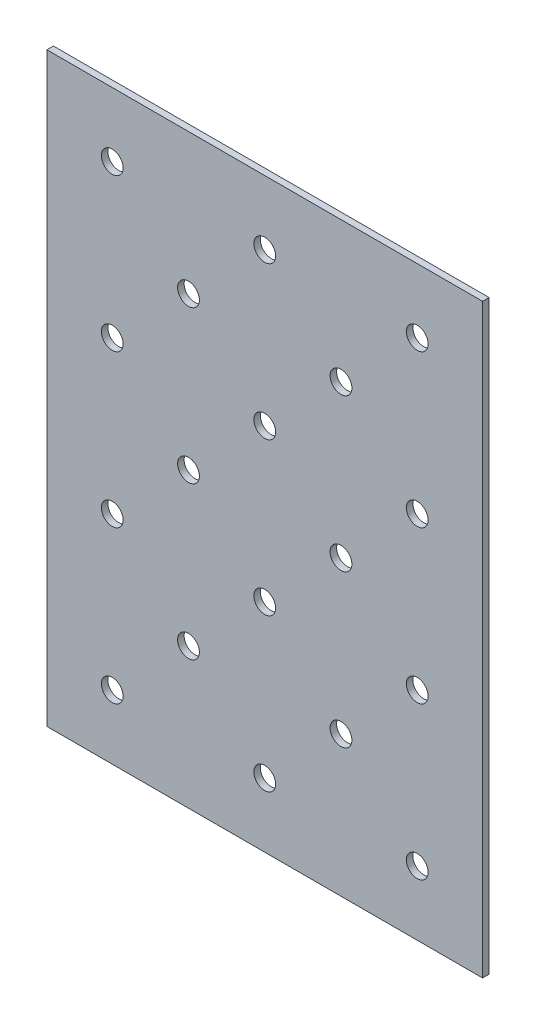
ISO-10303-21;
HEADER;
FILE_DESCRIPTION(('STEP AP214'),'2;1');
FILE_NAME('part.step','',(''),(''),'','','');
FILE_SCHEMA(('AUTOMOTIVE_DESIGN { 1 0 10303 214 1 1 1 1 }'));
ENDSEC;
DATA;
#1=APPLICATION_CONTEXT('core data for automotive mechanical design processes');
#2=APPLICATION_PROTOCOL_DEFINITION('international standard','automotive_design',2000,#1);
#3=PRODUCT_CONTEXT('',#1,'mechanical');
#4=PRODUCT('Part','Part','',(#3));
#5=PRODUCT_RELATED_PRODUCT_CATEGORY('part','',(#4));
#6=PRODUCT_DEFINITION_FORMATION('','',#4);
#7=PRODUCT_DEFINITION_CONTEXT('part definition',#1,'design');
#8=PRODUCT_DEFINITION('design','',#6,#7);
#9=PRODUCT_DEFINITION_SHAPE('','',#8);
#10=(LENGTH_UNIT() NAMED_UNIT(*) SI_UNIT(.MILLI.,.METRE.));
#11=(NAMED_UNIT(*) PLANE_ANGLE_UNIT() SI_UNIT($,.RADIAN.));
#12=(NAMED_UNIT(*) SI_UNIT($,.STERADIAN.) SOLID_ANGLE_UNIT());
#13=UNCERTAINTY_MEASURE_WITH_UNIT(LENGTH_MEASURE(1.E-05),#10,'distance_accuracy_value','');
#14=(GEOMETRIC_REPRESENTATION_CONTEXT(3) GLOBAL_UNCERTAINTY_ASSIGNED_CONTEXT((#13)) GLOBAL_UNIT_ASSIGNED_CONTEXT((#10,
#11,#12)) REPRESENTATION_CONTEXT('',''));
#15=CARTESIAN_POINT('',(0.,0.,0.));
#16=DIRECTION('',(0.,0.,1.));
#17=DIRECTION('',(1.,0.,0.));
#18=AXIS2_PLACEMENT_3D('',#15,#16,#17);
#19=CARTESIAN_POINT('',(15.6867576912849,294.5,3.));
#20=DIRECTION('',(-1.,0.,0.));
#21=DIRECTION('',(0.,-1.,0.));
#22=AXIS2_PLACEMENT_3D('',#19,#20,#21);
#23=PLANE('',#22);
#24=DIRECTION('',(0.,1.,0.));
#25=VECTOR('',#24,1.);
#26=CARTESIAN_POINT('',(15.6867576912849,294.5,0.));
#27=LINE('',#26,#25);
#28=CARTESIAN_POINT('',(15.6867576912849,25.5000000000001,0.));
#29=VERTEX_POINT('',#28);
#30=CARTESIAN_POINT('',(15.6867576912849,294.5,0.));
#31=VERTEX_POINT('',#30);
#32=EDGE_CURVE('E400',#29,#31,#27,.T.);
#33=ORIENTED_EDGE('',*,*,#32,.T.);
#34=DIRECTION('',(0.,0.,-1.));
#35=VECTOR('',#34,1.);
#36=CARTESIAN_POINT('',(15.6867576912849,294.5,3.));
#37=LINE('',#36,#35);
#38=CARTESIAN_POINT('',(15.6867576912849,294.5,3.));
#39=VERTEX_POINT('',#38);
#40=EDGE_CURVE('E11',#39,#31,#37,.T.);
#41=ORIENTED_EDGE('',*,*,#40,.F.);
#42=DIRECTION('',(0.,1.,0.));
#43=VECTOR('',#42,1.);
#44=CARTESIAN_POINT('',(15.6867576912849,294.5,3.));
#45=LINE('',#44,#43);
#46=CARTESIAN_POINT('',(15.6867576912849,25.5000000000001,3.));
#47=VERTEX_POINT('',#46);
#48=EDGE_CURVE('E423',#47,#39,#45,.T.);
#49=ORIENTED_EDGE('',*,*,#48,.F.);
#50=DIRECTION('',(0.,0.,-1.));
#51=VECTOR('',#50,1.);
#52=CARTESIAN_POINT('',(15.6867576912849,25.5000000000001,3.));
#53=LINE('',#52,#51);
#54=EDGE_CURVE('E412',#47,#29,#53,.T.);
#55=ORIENTED_EDGE('',*,*,#54,.T.);
#56=EDGE_LOOP('',(#33,#41,#49,#55));
#57=FACE_BOUND('',#56,.T.);
#58=ADVANCED_FACE('F356',(#57),#23,.F.);
#59=CARTESIAN_POINT('',(15.6867576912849,294.5,3.));
#60=DIRECTION('',(0.,-1.,0.));
#61=DIRECTION('',(1.,0.,0.));
#62=AXIS2_PLACEMENT_3D('',#59,#60,#61);
#63=PLANE('',#62);
#64=DIRECTION('',(-1.,0.,0.));
#65=VECTOR('',#64,1.);
#66=CARTESIAN_POINT('',(15.6867576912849,294.5,0.));
#67=LINE('',#66,#65);
#68=CARTESIAN_POINT('',(-184.313242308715,294.5,0.));
#69=VERTEX_POINT('',#68);
#70=EDGE_CURVE('E396',#31,#69,#67,.T.);
#71=ORIENTED_EDGE('',*,*,#70,.T.);
#72=DIRECTION('',(0.,0.,-1.));
#73=VECTOR('',#72,1.);
#74=CARTESIAN_POINT('',(-184.313242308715,294.5,3.));
#75=LINE('',#74,#73);
#76=CARTESIAN_POINT('',(-184.313242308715,294.5,3.));
#77=VERTEX_POINT('',#76);
#78=EDGE_CURVE('E363',#77,#69,#75,.T.);
#79=ORIENTED_EDGE('',*,*,#78,.F.);
#80=DIRECTION('',(-1.,0.,0.));
#81=VECTOR('',#80,1.);
#82=CARTESIAN_POINT('',(15.6867576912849,294.5,3.));
#83=LINE('',#82,#81);
#84=EDGE_CURVE('E408',#39,#77,#83,.T.);
#85=ORIENTED_EDGE('',*,*,#84,.F.);
#86=ORIENTED_EDGE('',*,*,#40,.T.);
#87=EDGE_LOOP('',(#71,#79,#85,#86));
#88=FACE_BOUND('',#87,.T.);
#89=ADVANCED_FACE('F407',(#88),#63,.F.);
#90=CARTESIAN_POINT('',(-184.313242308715,294.5,3.));
#91=DIRECTION('',(1.,0.,0.));
#92=DIRECTION('',(0.,1.,0.));
#93=AXIS2_PLACEMENT_3D('',#90,#91,#92);
#94=PLANE('',#93);
#95=DIRECTION('',(0.,-1.,0.));
#96=VECTOR('',#95,1.);
#97=CARTESIAN_POINT('',(-184.313242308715,294.5,0.));
#98=LINE('',#97,#96);
#99=CARTESIAN_POINT('',(-184.313242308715,25.5000000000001,0.));
#100=VERTEX_POINT('',#99);
#101=EDGE_CURVE('E401',#69,#100,#98,.T.);
#102=ORIENTED_EDGE('',*,*,#101,.T.);
#103=DIRECTION('',(0.,0.,-1.));
#104=VECTOR('',#103,1.);
#105=CARTESIAN_POINT('',(-184.313242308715,25.5000000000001,3.));
#106=LINE('',#105,#104);
#107=CARTESIAN_POINT('',(-184.313242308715,25.5000000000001,3.));
#108=VERTEX_POINT('',#107);
#109=EDGE_CURVE('E429',#108,#100,#106,.T.);
#110=ORIENTED_EDGE('',*,*,#109,.F.);
#111=DIRECTION('',(0.,-1.,0.));
#112=VECTOR('',#111,1.);
#113=CARTESIAN_POINT('',(-184.313242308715,294.5,3.));
#114=LINE('',#113,#112);
#115=EDGE_CURVE('E375',#77,#108,#114,.T.);
#116=ORIENTED_EDGE('',*,*,#115,.F.);
#117=ORIENTED_EDGE('',*,*,#78,.T.);
#118=EDGE_LOOP('',(#102,#110,#116,#117));
#119=FACE_BOUND('',#118,.T.);
#120=ADVANCED_FACE('F432',(#119),#94,.F.);
#121=CARTESIAN_POINT('',(15.6867576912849,25.5000000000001,3.));
#122=DIRECTION('',(0.,1.,0.));
#123=DIRECTION('',(-1.,0.,0.));
#124=AXIS2_PLACEMENT_3D('',#121,#122,#123);
#125=PLANE('',#124);
#126=DIRECTION('',(1.,0.,0.));
#127=VECTOR('',#126,1.);
#128=CARTESIAN_POINT('',(15.6867576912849,25.5000000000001,0.));
#129=LINE('',#128,#127);
#130=EDGE_CURVE('E421',#100,#29,#129,.T.);
#131=ORIENTED_EDGE('',*,*,#130,.T.);
#132=ORIENTED_EDGE('',*,*,#54,.F.);
#133=DIRECTION('',(1.,0.,0.));
#134=VECTOR('',#133,1.);
#135=CARTESIAN_POINT('',(15.6867576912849,25.5000000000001,3.));
#136=LINE('',#135,#134);
#137=EDGE_CURVE('E370',#108,#47,#136,.T.);
#138=ORIENTED_EDGE('',*,*,#137,.F.);
#139=ORIENTED_EDGE('',*,*,#109,.T.);
#140=EDGE_LOOP('',(#131,#132,#138,#139));
#141=FACE_BOUND('',#140,.T.);
#142=ADVANCED_FACE('F434',(#141),#125,.F.);
#143=CARTESIAN_POINT('',(15.6867576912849,25.5000000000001,3.));
#144=DIRECTION('',(0.,0.,-1.));
#145=DIRECTION('',(-1.,0.,0.));
#146=AXIS2_PLACEMENT_3D('',#143,#144,#145);
#147=PLANE('',#146);
#148=CARTESIAN_POINT('',(-14.3132423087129,55.,3.));
#149=DIRECTION('',(0.,0.,1.));
#150=DIRECTION('',(1.,0.,0.));
#151=AXIS2_PLACEMENT_3D('',#148,#149,#150);
#152=CIRCLE('',#151,5.);
#153=CARTESIAN_POINT('',(-9.31324230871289,55.,3.));
#154=VERTEX_POINT('',#153);
#155=EDGE_CURVE('E623',#154,#154,#152,.T.);
#156=ORIENTED_EDGE('',*,*,#155,.F.);
#157=EDGE_LOOP('',(#156));
#158=FACE_BOUND('',#157,.T.);
#159=CARTESIAN_POINT('',(-84.3132423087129,55.,3.));
#160=DIRECTION('',(0.,0.,1.));
#161=DIRECTION('',(1.,0.,0.));
#162=AXIS2_PLACEMENT_3D('',#159,#160,#161);
#163=CIRCLE('',#162,5.00000000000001);
#164=CARTESIAN_POINT('',(-79.3132423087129,55.,3.));
#165=VERTEX_POINT('',#164);
#166=EDGE_CURVE('E625',#165,#165,#163,.T.);
#167=ORIENTED_EDGE('',*,*,#166,.F.);
#168=EDGE_LOOP('',(#167));
#169=FACE_BOUND('',#168,.T.);
#170=CARTESIAN_POINT('',(-154.313242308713,55.,3.));
#171=DIRECTION('',(0.,0.,1.));
#172=DIRECTION('',(1.,0.,0.));
#173=AXIS2_PLACEMENT_3D('',#170,#171,#172);
#174=CIRCLE('',#173,4.99999999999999);
#175=CARTESIAN_POINT('',(-149.313242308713,55.,3.));
#176=VERTEX_POINT('',#175);
#177=EDGE_CURVE('E633',#176,#176,#174,.T.);
#178=ORIENTED_EDGE('',*,*,#177,.F.);
#179=EDGE_LOOP('',(#178));
#180=FACE_BOUND('',#179,.T.);
#181=CARTESIAN_POINT('',(-49.3132423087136,90.0000000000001,3.));
#182=DIRECTION('',(0.,0.,1.));
#183=DIRECTION('',(1.,0.,0.));
#184=AXIS2_PLACEMENT_3D('',#181,#182,#183);
#185=CIRCLE('',#184,5.);
#186=CARTESIAN_POINT('',(-44.3132423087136,90.0000000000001,3.));
#187=VERTEX_POINT('',#186);
#188=EDGE_CURVE('E639',#187,#187,#185,.T.);
#189=ORIENTED_EDGE('',*,*,#188,.F.);
#190=EDGE_LOOP('',(#189));
#191=FACE_BOUND('',#190,.T.);
#192=CARTESIAN_POINT('',(-119.313242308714,90.,3.));
#193=DIRECTION('',(0.,0.,1.));
#194=DIRECTION('',(1.,0.,0.));
#195=AXIS2_PLACEMENT_3D('',#192,#193,#194);
#196=CIRCLE('',#195,5.00000000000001);
#197=CARTESIAN_POINT('',(-114.313242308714,90.,3.));
#198=VERTEX_POINT('',#197);
#199=EDGE_CURVE('E645',#198,#198,#196,.T.);
#200=ORIENTED_EDGE('',*,*,#199,.F.);
#201=EDGE_LOOP('',(#200));
#202=FACE_BOUND('',#201,.T.);
#203=CARTESIAN_POINT('',(-14.3132423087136,125.,3.));
#204=DIRECTION('',(0.,0.,1.));
#205=DIRECTION('',(1.,0.,0.));
#206=AXIS2_PLACEMENT_3D('',#203,#204,#205);
#207=CIRCLE('',#206,5.);
#208=CARTESIAN_POINT('',(-9.31324230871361,125.,3.));
#209=VERTEX_POINT('',#208);
#210=EDGE_CURVE('E651',#209,#209,#207,.T.);
#211=ORIENTED_EDGE('',*,*,#210,.F.);
#212=EDGE_LOOP('',(#211));
#213=FACE_BOUND('',#212,.T.);
#214=CARTESIAN_POINT('',(-84.3132423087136,125.,3.));
#215=DIRECTION('',(0.,0.,1.));
#216=DIRECTION('',(1.,0.,0.));
#217=AXIS2_PLACEMENT_3D('',#214,#215,#216);
#218=CIRCLE('',#217,5.00000000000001);
#219=CARTESIAN_POINT('',(-79.3132423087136,125.,3.));
#220=VERTEX_POINT('',#219);
#221=EDGE_CURVE('E657',#220,#220,#218,.T.);
#222=ORIENTED_EDGE('',*,*,#221,.F.);
#223=EDGE_LOOP('',(#222));
#224=FACE_BOUND('',#223,.T.);
#225=CARTESIAN_POINT('',(-154.313242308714,125.,3.));
#226=DIRECTION('',(0.,0.,1.));
#227=DIRECTION('',(1.,0.,0.));
#228=AXIS2_PLACEMENT_3D('',#225,#226,#227);
#229=CIRCLE('',#228,4.99999999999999);
#230=CARTESIAN_POINT('',(-149.313242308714,125.,3.));
#231=VERTEX_POINT('',#230);
#232=EDGE_CURVE('E663',#231,#231,#229,.T.);
#233=ORIENTED_EDGE('',*,*,#232,.F.);
#234=EDGE_LOOP('',(#233));
#235=FACE_BOUND('',#234,.T.);
#236=CARTESIAN_POINT('',(-49.3132423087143,160.,3.));
#237=DIRECTION('',(0.,0.,1.));
#238=DIRECTION('',(1.,0.,0.));
#239=AXIS2_PLACEMENT_3D('',#236,#237,#238);
#240=CIRCLE('',#239,5.);
#241=CARTESIAN_POINT('',(-44.3132423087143,160.,3.));
#242=VERTEX_POINT('',#241);
#243=EDGE_CURVE('E669',#242,#242,#240,.T.);
#244=ORIENTED_EDGE('',*,*,#243,.F.);
#245=EDGE_LOOP('',(#244));
#246=FACE_BOUND('',#245,.T.);
#247=CARTESIAN_POINT('',(-119.313242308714,160.,3.));
#248=DIRECTION('',(0.,0.,1.));
#249=DIRECTION('',(1.,0.,0.));
#250=AXIS2_PLACEMENT_3D('',#247,#248,#249);
#251=CIRCLE('',#250,5.00000000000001);
#252=CARTESIAN_POINT('',(-114.313242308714,160.,3.));
#253=VERTEX_POINT('',#252);
#254=EDGE_CURVE('E675',#253,#253,#251,.T.);
#255=ORIENTED_EDGE('',*,*,#254,.F.);
#256=EDGE_LOOP('',(#255));
#257=FACE_BOUND('',#256,.T.);
#258=CARTESIAN_POINT('',(-14.3132423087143,195.,3.));
#259=DIRECTION('',(0.,0.,1.));
#260=DIRECTION('',(1.,0.,0.));
#261=AXIS2_PLACEMENT_3D('',#258,#259,#260);
#262=CIRCLE('',#261,5.);
#263=CARTESIAN_POINT('',(-9.31324230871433,195.,3.));
#264=VERTEX_POINT('',#263);
#265=EDGE_CURVE('E681',#264,#264,#262,.T.);
#266=ORIENTED_EDGE('',*,*,#265,.F.);
#267=EDGE_LOOP('',(#266));
#268=FACE_BOUND('',#267,.T.);
#269=CARTESIAN_POINT('',(-84.3132423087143,195.,3.));
#270=DIRECTION('',(0.,0.,1.));
#271=DIRECTION('',(1.,0.,0.));
#272=AXIS2_PLACEMENT_3D('',#269,#270,#271);
#273=CIRCLE('',#272,5.00000000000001);
#274=CARTESIAN_POINT('',(-79.3132423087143,195.,3.));
#275=VERTEX_POINT('',#274);
#276=EDGE_CURVE('E687',#275,#275,#273,.T.);
#277=ORIENTED_EDGE('',*,*,#276,.F.);
#278=EDGE_LOOP('',(#277));
#279=FACE_BOUND('',#278,.T.);
#280=CARTESIAN_POINT('',(-154.313242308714,195.,3.));
#281=DIRECTION('',(0.,0.,1.));
#282=DIRECTION('',(1.,0.,0.));
#283=AXIS2_PLACEMENT_3D('',#280,#281,#282);
#284=CIRCLE('',#283,4.99999999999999);
#285=CARTESIAN_POINT('',(-149.313242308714,195.,3.));
#286=VERTEX_POINT('',#285);
#287=EDGE_CURVE('E693',#286,#286,#284,.T.);
#288=ORIENTED_EDGE('',*,*,#287,.F.);
#289=EDGE_LOOP('',(#288));
#290=FACE_BOUND('',#289,.T.);
#291=CARTESIAN_POINT('',(-49.313242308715,230.,3.));
#292=DIRECTION('',(0.,0.,1.));
#293=DIRECTION('',(1.,0.,0.));
#294=AXIS2_PLACEMENT_3D('',#291,#292,#293);
#295=CIRCLE('',#294,5.);
#296=CARTESIAN_POINT('',(-44.313242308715,230.,3.));
#297=VERTEX_POINT('',#296);
#298=EDGE_CURVE('E699',#297,#297,#295,.T.);
#299=ORIENTED_EDGE('',*,*,#298,.F.);
#300=EDGE_LOOP('',(#299));
#301=FACE_BOUND('',#300,.T.);
#302=CARTESIAN_POINT('',(-119.313242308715,230.,3.));
#303=DIRECTION('',(0.,0.,1.));
#304=DIRECTION('',(1.,0.,0.));
#305=AXIS2_PLACEMENT_3D('',#302,#303,#304);
#306=CIRCLE('',#305,5.00000000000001);
#307=CARTESIAN_POINT('',(-114.313242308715,230.,3.));
#308=VERTEX_POINT('',#307);
#309=EDGE_CURVE('E705',#308,#308,#306,.T.);
#310=ORIENTED_EDGE('',*,*,#309,.F.);
#311=EDGE_LOOP('',(#310));
#312=FACE_BOUND('',#311,.T.);
#313=CARTESIAN_POINT('',(-14.3132423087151,265.,3.));
#314=DIRECTION('',(0.,0.,1.));
#315=DIRECTION('',(1.,0.,0.));
#316=AXIS2_PLACEMENT_3D('',#313,#314,#315);
#317=CIRCLE('',#316,5.);
#318=CARTESIAN_POINT('',(-9.31324230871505,265.,3.));
#319=VERTEX_POINT('',#318);
#320=EDGE_CURVE('E711',#319,#319,#317,.T.);
#321=ORIENTED_EDGE('',*,*,#320,.F.);
#322=EDGE_LOOP('',(#321));
#323=FACE_BOUND('',#322,.T.);
#324=CARTESIAN_POINT('',(-84.3132423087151,265.,3.));
#325=DIRECTION('',(0.,0.,1.));
#326=DIRECTION('',(1.,0.,0.));
#327=AXIS2_PLACEMENT_3D('',#324,#325,#326);
#328=CIRCLE('',#327,5.00000000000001);
#329=CARTESIAN_POINT('',(-79.3132423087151,265.,3.));
#330=VERTEX_POINT('',#329);
#331=EDGE_CURVE('E717',#330,#330,#328,.T.);
#332=ORIENTED_EDGE('',*,*,#331,.F.);
#333=EDGE_LOOP('',(#332));
#334=FACE_BOUND('',#333,.T.);
#335=CARTESIAN_POINT('',(-154.313242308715,265.,3.));
#336=DIRECTION('',(0.,0.,1.));
#337=DIRECTION('',(1.,0.,0.));
#338=AXIS2_PLACEMENT_3D('',#335,#336,#337);
#339=CIRCLE('',#338,4.99999999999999);
#340=CARTESIAN_POINT('',(-149.313242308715,265.,3.));
#341=VERTEX_POINT('',#340);
#342=EDGE_CURVE('E416',#341,#341,#339,.T.);
#343=ORIENTED_EDGE('',*,*,#342,.F.);
#344=EDGE_LOOP('',(#343));
#345=FACE_BOUND('',#344,.T.);
#346=ORIENTED_EDGE('',*,*,#48,.T.);
#347=ORIENTED_EDGE('',*,*,#84,.T.);
#348=ORIENTED_EDGE('',*,*,#115,.T.);
#349=ORIENTED_EDGE('',*,*,#137,.T.);
#350=EDGE_LOOP('',(#346,#347,#348,#349));
#351=FACE_BOUND('',#350,.T.);
#352=ADVANCED_FACE('F435',(#158,#169,#180,#191,#202,#213,#224,#235,#246,#257,#268,#279,#290,
#301,#312,#323,#334,#345,#351),#147,.F.);
#353=CARTESIAN_POINT('',(15.6867576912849,25.5000000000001,0.));
#354=DIRECTION('',(0.,0.,-1.));
#355=DIRECTION('',(-1.,0.,0.));
#356=AXIS2_PLACEMENT_3D('',#353,#354,#355);
#357=PLANE('',#356);
#358=CARTESIAN_POINT('',(-14.3132423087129,55.,0.));
#359=DIRECTION('',(0.,0.,1.));
#360=DIRECTION('',(1.,0.,0.));
#361=AXIS2_PLACEMENT_3D('',#358,#359,#360);
#362=CIRCLE('',#361,5.);
#363=CARTESIAN_POINT('',(-9.31324230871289,55.,0.));
#364=VERTEX_POINT('',#363);
#365=EDGE_CURVE('E621',#364,#364,#362,.T.);
#366=ORIENTED_EDGE('',*,*,#365,.T.);
#367=EDGE_LOOP('',(#366));
#368=FACE_BOUND('',#367,.T.);
#369=CARTESIAN_POINT('',(-84.3132423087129,55.,0.));
#370=DIRECTION('',(0.,0.,1.));
#371=DIRECTION('',(1.,0.,0.));
#372=AXIS2_PLACEMENT_3D('',#369,#370,#371);
#373=CIRCLE('',#372,5.00000000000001);
#374=CARTESIAN_POINT('',(-79.3132423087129,55.,0.));
#375=VERTEX_POINT('',#374);
#376=EDGE_CURVE('E630',#375,#375,#373,.T.);
#377=ORIENTED_EDGE('',*,*,#376,.T.);
#378=EDGE_LOOP('',(#377));
#379=FACE_BOUND('',#378,.T.);
#380=CARTESIAN_POINT('',(-154.313242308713,55.,0.));
#381=DIRECTION('',(0.,0.,1.));
#382=DIRECTION('',(1.,0.,0.));
#383=AXIS2_PLACEMENT_3D('',#380,#381,#382);
#384=CIRCLE('',#383,4.99999999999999);
#385=CARTESIAN_POINT('',(-149.313242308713,55.,0.));
#386=VERTEX_POINT('',#385);
#387=EDGE_CURVE('E636',#386,#386,#384,.T.);
#388=ORIENTED_EDGE('',*,*,#387,.T.);
#389=EDGE_LOOP('',(#388));
#390=FACE_BOUND('',#389,.T.);
#391=CARTESIAN_POINT('',(-49.3132423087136,90.0000000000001,0.));
#392=DIRECTION('',(0.,0.,1.));
#393=DIRECTION('',(1.,0.,0.));
#394=AXIS2_PLACEMENT_3D('',#391,#392,#393);
#395=CIRCLE('',#394,5.);
#396=CARTESIAN_POINT('',(-44.3132423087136,90.0000000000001,0.));
#397=VERTEX_POINT('',#396);
#398=EDGE_CURVE('E642',#397,#397,#395,.T.);
#399=ORIENTED_EDGE('',*,*,#398,.T.);
#400=EDGE_LOOP('',(#399));
#401=FACE_BOUND('',#400,.T.);
#402=CARTESIAN_POINT('',(-119.313242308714,90.,0.));
#403=DIRECTION('',(0.,0.,1.));
#404=DIRECTION('',(1.,0.,0.));
#405=AXIS2_PLACEMENT_3D('',#402,#403,#404);
#406=CIRCLE('',#405,5.00000000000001);
#407=CARTESIAN_POINT('',(-114.313242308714,90.,0.));
#408=VERTEX_POINT('',#407);
#409=EDGE_CURVE('E648',#408,#408,#406,.T.);
#410=ORIENTED_EDGE('',*,*,#409,.T.);
#411=EDGE_LOOP('',(#410));
#412=FACE_BOUND('',#411,.T.);
#413=CARTESIAN_POINT('',(-14.3132423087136,125.,0.));
#414=DIRECTION('',(0.,0.,1.));
#415=DIRECTION('',(1.,0.,0.));
#416=AXIS2_PLACEMENT_3D('',#413,#414,#415);
#417=CIRCLE('',#416,5.);
#418=CARTESIAN_POINT('',(-9.31324230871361,125.,0.));
#419=VERTEX_POINT('',#418);
#420=EDGE_CURVE('E654',#419,#419,#417,.T.);
#421=ORIENTED_EDGE('',*,*,#420,.T.);
#422=EDGE_LOOP('',(#421));
#423=FACE_BOUND('',#422,.T.);
#424=CARTESIAN_POINT('',(-84.3132423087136,125.,0.));
#425=DIRECTION('',(0.,0.,1.));
#426=DIRECTION('',(1.,0.,0.));
#427=AXIS2_PLACEMENT_3D('',#424,#425,#426);
#428=CIRCLE('',#427,5.00000000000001);
#429=CARTESIAN_POINT('',(-79.3132423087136,125.,0.));
#430=VERTEX_POINT('',#429);
#431=EDGE_CURVE('E660',#430,#430,#428,.T.);
#432=ORIENTED_EDGE('',*,*,#431,.T.);
#433=EDGE_LOOP('',(#432));
#434=FACE_BOUND('',#433,.T.);
#435=CARTESIAN_POINT('',(-154.313242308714,125.,0.));
#436=DIRECTION('',(0.,0.,1.));
#437=DIRECTION('',(1.,0.,0.));
#438=AXIS2_PLACEMENT_3D('',#435,#436,#437);
#439=CIRCLE('',#438,4.99999999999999);
#440=CARTESIAN_POINT('',(-149.313242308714,125.,0.));
#441=VERTEX_POINT('',#440);
#442=EDGE_CURVE('E666',#441,#441,#439,.T.);
#443=ORIENTED_EDGE('',*,*,#442,.T.);
#444=EDGE_LOOP('',(#443));
#445=FACE_BOUND('',#444,.T.);
#446=CARTESIAN_POINT('',(-49.3132423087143,160.,0.));
#447=DIRECTION('',(0.,0.,1.));
#448=DIRECTION('',(1.,0.,0.));
#449=AXIS2_PLACEMENT_3D('',#446,#447,#448);
#450=CIRCLE('',#449,5.);
#451=CARTESIAN_POINT('',(-44.3132423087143,160.,0.));
#452=VERTEX_POINT('',#451);
#453=EDGE_CURVE('E672',#452,#452,#450,.T.);
#454=ORIENTED_EDGE('',*,*,#453,.T.);
#455=EDGE_LOOP('',(#454));
#456=FACE_BOUND('',#455,.T.);
#457=CARTESIAN_POINT('',(-119.313242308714,160.,0.));
#458=DIRECTION('',(0.,0.,1.));
#459=DIRECTION('',(1.,0.,0.));
#460=AXIS2_PLACEMENT_3D('',#457,#458,#459);
#461=CIRCLE('',#460,5.00000000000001);
#462=CARTESIAN_POINT('',(-114.313242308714,160.,0.));
#463=VERTEX_POINT('',#462);
#464=EDGE_CURVE('E678',#463,#463,#461,.T.);
#465=ORIENTED_EDGE('',*,*,#464,.T.);
#466=EDGE_LOOP('',(#465));
#467=FACE_BOUND('',#466,.T.);
#468=CARTESIAN_POINT('',(-14.3132423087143,195.,0.));
#469=DIRECTION('',(0.,0.,1.));
#470=DIRECTION('',(1.,0.,0.));
#471=AXIS2_PLACEMENT_3D('',#468,#469,#470);
#472=CIRCLE('',#471,5.);
#473=CARTESIAN_POINT('',(-9.31324230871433,195.,0.));
#474=VERTEX_POINT('',#473);
#475=EDGE_CURVE('E684',#474,#474,#472,.T.);
#476=ORIENTED_EDGE('',*,*,#475,.T.);
#477=EDGE_LOOP('',(#476));
#478=FACE_BOUND('',#477,.T.);
#479=CARTESIAN_POINT('',(-84.3132423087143,195.,0.));
#480=DIRECTION('',(0.,0.,1.));
#481=DIRECTION('',(1.,0.,0.));
#482=AXIS2_PLACEMENT_3D('',#479,#480,#481);
#483=CIRCLE('',#482,5.00000000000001);
#484=CARTESIAN_POINT('',(-79.3132423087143,195.,0.));
#485=VERTEX_POINT('',#484);
#486=EDGE_CURVE('E690',#485,#485,#483,.T.);
#487=ORIENTED_EDGE('',*,*,#486,.T.);
#488=EDGE_LOOP('',(#487));
#489=FACE_BOUND('',#488,.T.);
#490=CARTESIAN_POINT('',(-154.313242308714,195.,0.));
#491=DIRECTION('',(0.,0.,1.));
#492=DIRECTION('',(1.,0.,0.));
#493=AXIS2_PLACEMENT_3D('',#490,#491,#492);
#494=CIRCLE('',#493,4.99999999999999);
#495=CARTESIAN_POINT('',(-149.313242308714,195.,0.));
#496=VERTEX_POINT('',#495);
#497=EDGE_CURVE('E696',#496,#496,#494,.T.);
#498=ORIENTED_EDGE('',*,*,#497,.T.);
#499=EDGE_LOOP('',(#498));
#500=FACE_BOUND('',#499,.T.);
#501=CARTESIAN_POINT('',(-49.313242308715,230.,0.));
#502=DIRECTION('',(0.,0.,1.));
#503=DIRECTION('',(1.,0.,0.));
#504=AXIS2_PLACEMENT_3D('',#501,#502,#503);
#505=CIRCLE('',#504,5.);
#506=CARTESIAN_POINT('',(-44.313242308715,230.,0.));
#507=VERTEX_POINT('',#506);
#508=EDGE_CURVE('E702',#507,#507,#505,.T.);
#509=ORIENTED_EDGE('',*,*,#508,.T.);
#510=EDGE_LOOP('',(#509));
#511=FACE_BOUND('',#510,.T.);
#512=CARTESIAN_POINT('',(-119.313242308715,230.,0.));
#513=DIRECTION('',(0.,0.,1.));
#514=DIRECTION('',(1.,0.,0.));
#515=AXIS2_PLACEMENT_3D('',#512,#513,#514);
#516=CIRCLE('',#515,5.00000000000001);
#517=CARTESIAN_POINT('',(-114.313242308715,230.,0.));
#518=VERTEX_POINT('',#517);
#519=EDGE_CURVE('E708',#518,#518,#516,.T.);
#520=ORIENTED_EDGE('',*,*,#519,.T.);
#521=EDGE_LOOP('',(#520));
#522=FACE_BOUND('',#521,.T.);
#523=CARTESIAN_POINT('',(-14.3132423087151,265.,0.));
#524=DIRECTION('',(0.,0.,1.));
#525=DIRECTION('',(1.,0.,0.));
#526=AXIS2_PLACEMENT_3D('',#523,#524,#525);
#527=CIRCLE('',#526,5.);
#528=CARTESIAN_POINT('',(-9.31324230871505,265.,0.));
#529=VERTEX_POINT('',#528);
#530=EDGE_CURVE('E714',#529,#529,#527,.T.);
#531=ORIENTED_EDGE('',*,*,#530,.T.);
#532=EDGE_LOOP('',(#531));
#533=FACE_BOUND('',#532,.T.);
#534=CARTESIAN_POINT('',(-84.3132423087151,265.,0.));
#535=DIRECTION('',(0.,0.,1.));
#536=DIRECTION('',(1.,0.,0.));
#537=AXIS2_PLACEMENT_3D('',#534,#535,#536);
#538=CIRCLE('',#537,5.00000000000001);
#539=CARTESIAN_POINT('',(-79.3132423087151,265.,0.));
#540=VERTEX_POINT('',#539);
#541=EDGE_CURVE('E720',#540,#540,#538,.T.);
#542=ORIENTED_EDGE('',*,*,#541,.T.);
#543=EDGE_LOOP('',(#542));
#544=FACE_BOUND('',#543,.T.);
#545=CARTESIAN_POINT('',(-154.313242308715,265.,0.));
#546=DIRECTION('',(0.,0.,1.));
#547=DIRECTION('',(1.,0.,0.));
#548=AXIS2_PLACEMENT_3D('',#545,#546,#547);
#549=CIRCLE('',#548,4.99999999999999);
#550=CARTESIAN_POINT('',(-149.313242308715,265.,0.));
#551=VERTEX_POINT('',#550);
#552=EDGE_CURVE('E413',#551,#551,#549,.T.);
#553=ORIENTED_EDGE('',*,*,#552,.T.);
#554=EDGE_LOOP('',(#553));
#555=FACE_BOUND('',#554,.T.);
#556=ORIENTED_EDGE('',*,*,#32,.F.);
#557=ORIENTED_EDGE('',*,*,#130,.F.);
#558=ORIENTED_EDGE('',*,*,#101,.F.);
#559=ORIENTED_EDGE('',*,*,#70,.F.);
#560=EDGE_LOOP('',(#556,#557,#558,#559));
#561=FACE_BOUND('',#560,.T.);
#562=ADVANCED_FACE('F397',(#368,#379,#390,#401,#412,#423,#434,#445,#456,#467,#478,#489,#500,
#511,#522,#533,#544,#555,#561),#357,.T.);
#563=CARTESIAN_POINT('',(-154.313242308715,265.,0.));
#564=DIRECTION('',(0.,0.,1.));
#565=DIRECTION('',(1.,0.,0.));
#566=AXIS2_PLACEMENT_3D('',#563,#564,#565);
#567=CYLINDRICAL_SURFACE('',#566,4.99999999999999);
#568=ORIENTED_EDGE('',*,*,#552,.F.);
#569=EDGE_LOOP('',(#568));
#570=FACE_BOUND('',#569,.T.);
#571=ORIENTED_EDGE('',*,*,#342,.T.);
#572=EDGE_LOOP('',(#571));
#573=FACE_BOUND('',#572,.T.);
#574=ADVANCED_FACE('F443',(#570,#573),#567,.F.);
#575=CARTESIAN_POINT('',(-84.3132423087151,265.,0.));
#576=DIRECTION('',(0.,0.,1.));
#577=DIRECTION('',(1.,0.,0.));
#578=AXIS2_PLACEMENT_3D('',#575,#576,#577);
#579=CYLINDRICAL_SURFACE('',#578,5.00000000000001);
#580=ORIENTED_EDGE('',*,*,#541,.F.);
#581=EDGE_LOOP('',(#580));
#582=FACE_BOUND('',#581,.T.);
#583=ORIENTED_EDGE('',*,*,#331,.T.);
#584=EDGE_LOOP('',(#583));
#585=FACE_BOUND('',#584,.T.);
#586=ADVANCED_FACE('F479',(#582,#585),#579,.F.);
#587=CARTESIAN_POINT('',(-14.3132423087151,265.,0.));
#588=DIRECTION('',(0.,0.,1.));
#589=DIRECTION('',(1.,0.,0.));
#590=AXIS2_PLACEMENT_3D('',#587,#588,#589);
#591=CYLINDRICAL_SURFACE('',#590,5.);
#592=ORIENTED_EDGE('',*,*,#530,.F.);
#593=EDGE_LOOP('',(#592));
#594=FACE_BOUND('',#593,.T.);
#595=ORIENTED_EDGE('',*,*,#320,.T.);
#596=EDGE_LOOP('',(#595));
#597=FACE_BOUND('',#596,.T.);
#598=ADVANCED_FACE('F487',(#594,#597),#591,.F.);
#599=CARTESIAN_POINT('',(-119.313242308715,230.,0.));
#600=DIRECTION('',(0.,0.,1.));
#601=DIRECTION('',(1.,0.,0.));
#602=AXIS2_PLACEMENT_3D('',#599,#600,#601);
#603=CYLINDRICAL_SURFACE('',#602,5.00000000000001);
#604=ORIENTED_EDGE('',*,*,#519,.F.);
#605=EDGE_LOOP('',(#604));
#606=FACE_BOUND('',#605,.T.);
#607=ORIENTED_EDGE('',*,*,#309,.T.);
#608=EDGE_LOOP('',(#607));
#609=FACE_BOUND('',#608,.T.);
#610=ADVANCED_FACE('F495',(#606,#609),#603,.F.);
#611=CARTESIAN_POINT('',(-49.313242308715,230.,0.));
#612=DIRECTION('',(0.,0.,1.));
#613=DIRECTION('',(1.,0.,0.));
#614=AXIS2_PLACEMENT_3D('',#611,#612,#613);
#615=CYLINDRICAL_SURFACE('',#614,5.);
#616=ORIENTED_EDGE('',*,*,#508,.F.);
#617=EDGE_LOOP('',(#616));
#618=FACE_BOUND('',#617,.T.);
#619=ORIENTED_EDGE('',*,*,#298,.T.);
#620=EDGE_LOOP('',(#619));
#621=FACE_BOUND('',#620,.T.);
#622=ADVANCED_FACE('F503',(#618,#621),#615,.F.);
#623=CARTESIAN_POINT('',(-154.313242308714,195.,0.));
#624=DIRECTION('',(0.,0.,1.));
#625=DIRECTION('',(1.,0.,0.));
#626=AXIS2_PLACEMENT_3D('',#623,#624,#625);
#627=CYLINDRICAL_SURFACE('',#626,4.99999999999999);
#628=ORIENTED_EDGE('',*,*,#497,.F.);
#629=EDGE_LOOP('',(#628));
#630=FACE_BOUND('',#629,.T.);
#631=ORIENTED_EDGE('',*,*,#287,.T.);
#632=EDGE_LOOP('',(#631));
#633=FACE_BOUND('',#632,.T.);
#634=ADVANCED_FACE('F511',(#630,#633),#627,.F.);
#635=CARTESIAN_POINT('',(-84.3132423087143,195.,0.));
#636=DIRECTION('',(0.,0.,1.));
#637=DIRECTION('',(1.,0.,0.));
#638=AXIS2_PLACEMENT_3D('',#635,#636,#637);
#639=CYLINDRICAL_SURFACE('',#638,5.00000000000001);
#640=ORIENTED_EDGE('',*,*,#486,.F.);
#641=EDGE_LOOP('',(#640));
#642=FACE_BOUND('',#641,.T.);
#643=ORIENTED_EDGE('',*,*,#276,.T.);
#644=EDGE_LOOP('',(#643));
#645=FACE_BOUND('',#644,.T.);
#646=ADVANCED_FACE('F519',(#642,#645),#639,.F.);
#647=CARTESIAN_POINT('',(-14.3132423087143,195.,0.));
#648=DIRECTION('',(0.,0.,1.));
#649=DIRECTION('',(1.,0.,0.));
#650=AXIS2_PLACEMENT_3D('',#647,#648,#649);
#651=CYLINDRICAL_SURFACE('',#650,5.);
#652=ORIENTED_EDGE('',*,*,#475,.F.);
#653=EDGE_LOOP('',(#652));
#654=FACE_BOUND('',#653,.T.);
#655=ORIENTED_EDGE('',*,*,#265,.T.);
#656=EDGE_LOOP('',(#655));
#657=FACE_BOUND('',#656,.T.);
#658=ADVANCED_FACE('F527',(#654,#657),#651,.F.);
#659=CARTESIAN_POINT('',(-119.313242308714,160.,0.));
#660=DIRECTION('',(0.,0.,1.));
#661=DIRECTION('',(1.,0.,0.));
#662=AXIS2_PLACEMENT_3D('',#659,#660,#661);
#663=CYLINDRICAL_SURFACE('',#662,5.00000000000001);
#664=ORIENTED_EDGE('',*,*,#464,.F.);
#665=EDGE_LOOP('',(#664));
#666=FACE_BOUND('',#665,.T.);
#667=ORIENTED_EDGE('',*,*,#254,.T.);
#668=EDGE_LOOP('',(#667));
#669=FACE_BOUND('',#668,.T.);
#670=ADVANCED_FACE('F535',(#666,#669),#663,.F.);
#671=CARTESIAN_POINT('',(-49.3132423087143,160.,0.));
#672=DIRECTION('',(0.,0.,1.));
#673=DIRECTION('',(1.,0.,0.));
#674=AXIS2_PLACEMENT_3D('',#671,#672,#673);
#675=CYLINDRICAL_SURFACE('',#674,5.);
#676=ORIENTED_EDGE('',*,*,#453,.F.);
#677=EDGE_LOOP('',(#676));
#678=FACE_BOUND('',#677,.T.);
#679=ORIENTED_EDGE('',*,*,#243,.T.);
#680=EDGE_LOOP('',(#679));
#681=FACE_BOUND('',#680,.T.);
#682=ADVANCED_FACE('F543',(#678,#681),#675,.F.);
#683=CARTESIAN_POINT('',(-154.313242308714,125.,0.));
#684=DIRECTION('',(0.,0.,1.));
#685=DIRECTION('',(1.,0.,0.));
#686=AXIS2_PLACEMENT_3D('',#683,#684,#685);
#687=CYLINDRICAL_SURFACE('',#686,4.99999999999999);
#688=ORIENTED_EDGE('',*,*,#442,.F.);
#689=EDGE_LOOP('',(#688));
#690=FACE_BOUND('',#689,.T.);
#691=ORIENTED_EDGE('',*,*,#232,.T.);
#692=EDGE_LOOP('',(#691));
#693=FACE_BOUND('',#692,.T.);
#694=ADVANCED_FACE('F551',(#690,#693),#687,.F.);
#695=CARTESIAN_POINT('',(-84.3132423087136,125.,0.));
#696=DIRECTION('',(0.,0.,1.));
#697=DIRECTION('',(1.,0.,0.));
#698=AXIS2_PLACEMENT_3D('',#695,#696,#697);
#699=CYLINDRICAL_SURFACE('',#698,5.00000000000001);
#700=ORIENTED_EDGE('',*,*,#431,.F.);
#701=EDGE_LOOP('',(#700));
#702=FACE_BOUND('',#701,.T.);
#703=ORIENTED_EDGE('',*,*,#221,.T.);
#704=EDGE_LOOP('',(#703));
#705=FACE_BOUND('',#704,.T.);
#706=ADVANCED_FACE('F559',(#702,#705),#699,.F.);
#707=CARTESIAN_POINT('',(-14.3132423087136,125.,0.));
#708=DIRECTION('',(0.,0.,1.));
#709=DIRECTION('',(1.,0.,0.));
#710=AXIS2_PLACEMENT_3D('',#707,#708,#709);
#711=CYLINDRICAL_SURFACE('',#710,5.);
#712=ORIENTED_EDGE('',*,*,#420,.F.);
#713=EDGE_LOOP('',(#712));
#714=FACE_BOUND('',#713,.T.);
#715=ORIENTED_EDGE('',*,*,#210,.T.);
#716=EDGE_LOOP('',(#715));
#717=FACE_BOUND('',#716,.T.);
#718=ADVANCED_FACE('F567',(#714,#717),#711,.F.);
#719=CARTESIAN_POINT('',(-119.313242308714,90.,0.));
#720=DIRECTION('',(0.,0.,1.));
#721=DIRECTION('',(1.,0.,0.));
#722=AXIS2_PLACEMENT_3D('',#719,#720,#721);
#723=CYLINDRICAL_SURFACE('',#722,5.00000000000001);
#724=ORIENTED_EDGE('',*,*,#409,.F.);
#725=EDGE_LOOP('',(#724));
#726=FACE_BOUND('',#725,.T.);
#727=ORIENTED_EDGE('',*,*,#199,.T.);
#728=EDGE_LOOP('',(#727));
#729=FACE_BOUND('',#728,.T.);
#730=ADVANCED_FACE('F575',(#726,#729),#723,.F.);
#731=CARTESIAN_POINT('',(-49.3132423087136,90.0000000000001,0.));
#732=DIRECTION('',(0.,0.,1.));
#733=DIRECTION('',(1.,0.,0.));
#734=AXIS2_PLACEMENT_3D('',#731,#732,#733);
#735=CYLINDRICAL_SURFACE('',#734,5.);
#736=ORIENTED_EDGE('',*,*,#398,.F.);
#737=EDGE_LOOP('',(#736));
#738=FACE_BOUND('',#737,.T.);
#739=ORIENTED_EDGE('',*,*,#188,.T.);
#740=EDGE_LOOP('',(#739));
#741=FACE_BOUND('',#740,.T.);
#742=ADVANCED_FACE('F583',(#738,#741),#735,.F.);
#743=CARTESIAN_POINT('',(-154.313242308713,55.,0.));
#744=DIRECTION('',(0.,0.,1.));
#745=DIRECTION('',(1.,0.,0.));
#746=AXIS2_PLACEMENT_3D('',#743,#744,#745);
#747=CYLINDRICAL_SURFACE('',#746,4.99999999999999);
#748=ORIENTED_EDGE('',*,*,#387,.F.);
#749=EDGE_LOOP('',(#748));
#750=FACE_BOUND('',#749,.T.);
#751=ORIENTED_EDGE('',*,*,#177,.T.);
#752=EDGE_LOOP('',(#751));
#753=FACE_BOUND('',#752,.T.);
#754=ADVANCED_FACE('F591',(#750,#753),#747,.F.);
#755=CARTESIAN_POINT('',(-84.3132423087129,55.,0.));
#756=DIRECTION('',(0.,0.,1.));
#757=DIRECTION('',(1.,0.,0.));
#758=AXIS2_PLACEMENT_3D('',#755,#756,#757);
#759=CYLINDRICAL_SURFACE('',#758,5.00000000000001);
#760=ORIENTED_EDGE('',*,*,#376,.F.);
#761=EDGE_LOOP('',(#760));
#762=FACE_BOUND('',#761,.T.);
#763=ORIENTED_EDGE('',*,*,#166,.T.);
#764=EDGE_LOOP('',(#763));
#765=FACE_BOUND('',#764,.T.);
#766=ADVANCED_FACE('F599',(#762,#765),#759,.F.);
#767=CARTESIAN_POINT('',(-14.3132423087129,55.,0.));
#768=DIRECTION('',(0.,0.,1.));
#769=DIRECTION('',(1.,0.,0.));
#770=AXIS2_PLACEMENT_3D('',#767,#768,#769);
#771=CYLINDRICAL_SURFACE('',#770,5.);
#772=ORIENTED_EDGE('',*,*,#365,.F.);
#773=EDGE_LOOP('',(#772));
#774=FACE_BOUND('',#773,.T.);
#775=ORIENTED_EDGE('',*,*,#155,.T.);
#776=EDGE_LOOP('',(#775));
#777=FACE_BOUND('',#776,.T.);
#778=ADVANCED_FACE('F607',(#774,#777),#771,.F.);
#779=CLOSED_SHELL('',(#58,#89,#120,#142,#352,#562,#574,#586,#598,#610,#622,#634,#646,#658,#670,
#682,#694,#706,#718,#730,#742,#754,#766,#778));
#780=MANIFOLD_SOLID_BREP('B2',#779);
#781=ADVANCED_BREP_SHAPE_REPRESENTATION('',(#18,#780),#14);
#782=SHAPE_DEFINITION_REPRESENTATION(#9,#781);
ENDSEC;
END-ISO-10303-21;
